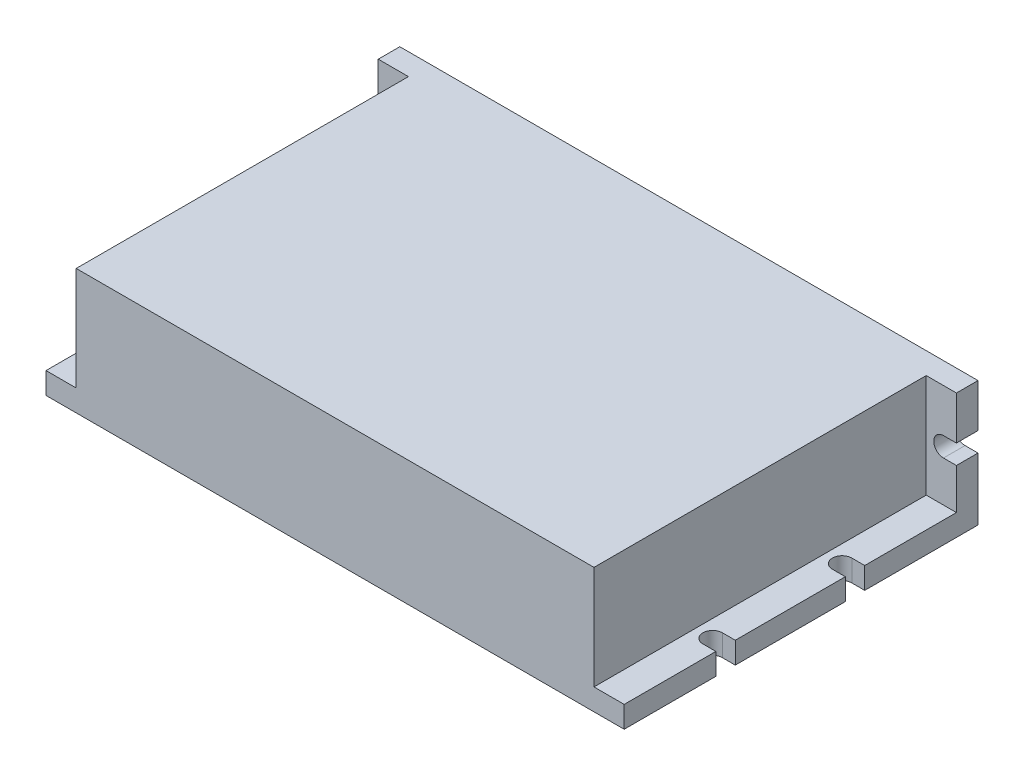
from build123d import *

# Parameters (mm, degrees)
SKETCH_1_W          = 134
SKETCH_1_H          = 82
EXTRUDE_1_DEPTH     = 29
SKETCH_2_W          = 7
SKETCH_2_H          = 24
CUT_EXTRUDE_1_DEPTH = 77
CUT_EXTRUDE_2_DEPTH = 52
CUT_EXTRUDE_3_DEPTH = 5


with BuildPart() as part:
    # Sketch 1 → Extrude 1 (new body)
    with BuildSketch(Plane(origin=(0, 0, 0), x_dir=(1, 0, 0), z_dir=(0, 1, 0))):
        with Locations((67, 41)):
            Rectangle(SKETCH_1_W, SKETCH_1_H)
    extrude(amount=EXTRUDE_1_DEPTH)

    # Sketch 2 → Cut-Extrude 1 (cut)
    with BuildSketch(Plane.XY):
        with Locations((3.5, 17)):
            Rectangle(SKETCH_2_W, SKETCH_2_H)
        with Locations((130.5, 17)):
            Rectangle(SKETCH_2_W, SKETCH_2_H)
    extrude(amount=-CUT_EXTRUDE_1_DEPTH, mode=Mode.SUBTRACT)

    # Sketch 3 → Cut-Extrude 2 (cut)
    with BuildSketch(Plane.XY.offset(-77)):
        with BuildLine():
            Line((131, 18.95), (134, 18.95))
            Line((134, 18.95), (134, 14.45))
            Line((134, 14.45), (131, 14.45))
            ThreePointArc((131, 14.45), (128.75, 16.7), (131, 18.95))
        make_face()
        with BuildLine():
            Line((3, 18.95), (0, 18.95))
            Line((0, 18.95), (0, 14.45))
            Line((0, 14.45), (3, 14.45))
            ThreePointArc((3, 14.45), (5.25, 16.7), (3, 18.95))
        make_face()
    extrude(amount=-CUT_EXTRUDE_2_DEPTH, mode=Mode.SUBTRACT)

    # Sketch 4 → Cut-Extrude 3 (cut)
    with BuildSketch(Plane(origin=(0, 5, 0), x_dir=(1, 0, 0), z_dir=(0, 1, 0))):
        with BuildLine():
            Line((3, 25.75), (0, 25.75))
            Line((0, 25.75), (0, 21.25))
            Line((0, 21.25), (3, 21.25))
            ThreePointArc((3, 21.25), (5.25, 23.5), (3, 25.75))
        make_face()
        with BuildLine():
            Line((3, 55.75), (0, 55.75))
            Line((0, 55.75), (0, 51.25))
            Line((0, 51.25), (3, 51.25))
            ThreePointArc((3, 51.25), (5.25, 53.5), (3, 55.75))
        make_face()
        with BuildLine():
            Line((131, 55.75), (134, 55.75))
            Line((134, 55.75), (134, 51.25))
            Line((134, 51.25), (131, 51.25))
            ThreePointArc((131, 51.25), (128.75, 53.5), (131, 55.75))
        make_face()
        with BuildLine():
            Line((131, 25.75), (134, 25.75))
            Line((134, 25.75), (134, 21.25))
            Line((134, 21.25), (131, 21.25))
            ThreePointArc((131, 21.25), (128.75, 23.5), (131, 25.75))
        make_face()
    extrude(amount=-CUT_EXTRUDE_3_DEPTH, mode=Mode.SUBTRACT)


solid = part.part
